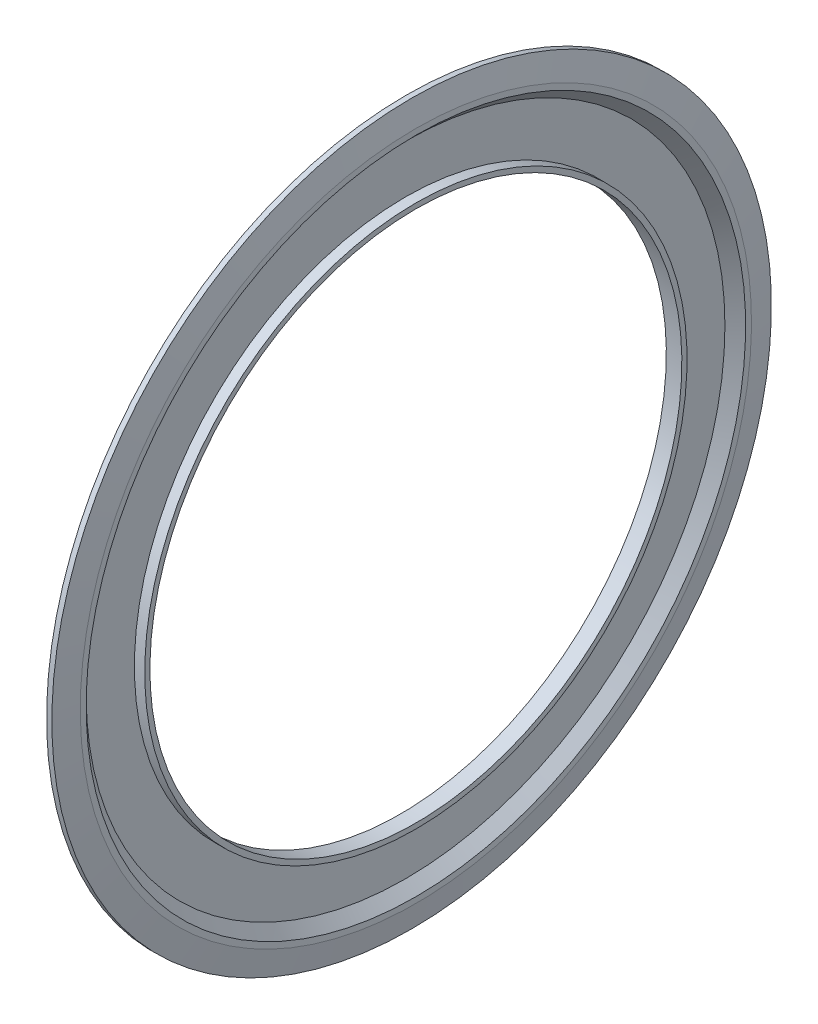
ISO-10303-21;
HEADER;
FILE_DESCRIPTION(('STEP AP214'),'2;1');
FILE_NAME('part.step','',(''),(''),'','','');
FILE_SCHEMA(('AUTOMOTIVE_DESIGN { 1 0 10303 214 1 1 1 1 }'));
ENDSEC;
DATA;
#1=APPLICATION_CONTEXT('core data for automotive mechanical design processes');
#2=APPLICATION_PROTOCOL_DEFINITION('international standard','automotive_design',2000,#1);
#3=PRODUCT_CONTEXT('',#1,'mechanical');
#4=PRODUCT('Part','Part','',(#3));
#5=PRODUCT_RELATED_PRODUCT_CATEGORY('part','',(#4));
#6=PRODUCT_DEFINITION_FORMATION('','',#4);
#7=PRODUCT_DEFINITION_CONTEXT('part definition',#1,'design');
#8=PRODUCT_DEFINITION('design','',#6,#7);
#9=PRODUCT_DEFINITION_SHAPE('','',#8);
#10=(LENGTH_UNIT() NAMED_UNIT(*) SI_UNIT(.MILLI.,.METRE.));
#11=(NAMED_UNIT(*) PLANE_ANGLE_UNIT() SI_UNIT($,.RADIAN.));
#12=(NAMED_UNIT(*) SI_UNIT($,.STERADIAN.) SOLID_ANGLE_UNIT());
#13=UNCERTAINTY_MEASURE_WITH_UNIT(LENGTH_MEASURE(1.E-05),#10,'distance_accuracy_value','');
#14=(GEOMETRIC_REPRESENTATION_CONTEXT(3) GLOBAL_UNCERTAINTY_ASSIGNED_CONTEXT((#13)) GLOBAL_UNIT_ASSIGNED_CONTEXT((#10,
#11,#12)) REPRESENTATION_CONTEXT('',''));
#15=CARTESIAN_POINT('',(0.,0.,0.));
#16=DIRECTION('',(0.,0.,1.));
#17=DIRECTION('',(1.,0.,0.));
#18=AXIS2_PLACEMENT_3D('',#15,#16,#17);
#19=CARTESIAN_POINT('',(1.32622244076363,21.783,0.));
#20=DIRECTION('',(1.,0.,0.));
#21=DIRECTION('',(0.,-1.,0.));
#22=AXIS2_PLACEMENT_3D('',#19,#20,#21);
#23=PLANE('',#22);
#24=CARTESIAN_POINT('',(1.32622244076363,0.,0.));
#25=DIRECTION('',(-1.,0.,0.));
#26=DIRECTION('',(0.,1.,0.));
#27=AXIS2_PLACEMENT_3D('',#24,#25,#26);
#28=CIRCLE('',#27,21.591);
#29=CARTESIAN_POINT('',(1.32622244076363,21.591,0.));
#30=VERTEX_POINT('',#29);
#31=EDGE_CURVE('E11',#30,#30,#28,.T.);
#32=ORIENTED_EDGE('',*,*,#31,.T.);
#33=EDGE_LOOP('',(#32));
#34=FACE_BOUND('',#33,.T.);
#35=CARTESIAN_POINT('',(1.32622244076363,0.,0.));
#36=DIRECTION('',(-1.,0.,0.));
#37=DIRECTION('',(0.,1.,0.));
#38=AXIS2_PLACEMENT_3D('',#35,#36,#37);
#39=CIRCLE('',#38,21.975);
#40=CARTESIAN_POINT('',(1.32622244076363,21.975,0.));
#41=VERTEX_POINT('',#40);
#42=EDGE_CURVE('E77',#41,#41,#39,.T.);
#43=ORIENTED_EDGE('',*,*,#42,.F.);
#44=EDGE_LOOP('',(#43));
#45=FACE_BOUND('',#44,.T.);
#46=ADVANCED_FACE('F16',(#34,#45),#23,.T.);
#47=CARTESIAN_POINT('',(0.987222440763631,0.,0.));
#48=DIRECTION('',(1.,0.,0.));
#49=DIRECTION('',(0.,1.,0.));
#50=AXIS2_PLACEMENT_3D('',#47,#48,#49);
#51=CONICAL_SURFACE('',#50,21.252,0.785398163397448);
#52=CARTESIAN_POINT('',(0.648222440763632,0.,0.));
#53=DIRECTION('',(-1.,0.,0.));
#54=DIRECTION('',(0.,1.,0.));
#55=AXIS2_PLACEMENT_3D('',#52,#53,#54);
#56=CIRCLE('',#55,20.913);
#57=CARTESIAN_POINT('',(0.648222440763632,20.913,0.));
#58=VERTEX_POINT('',#57);
#59=EDGE_CURVE('E26',#58,#58,#56,.T.);
#60=ORIENTED_EDGE('',*,*,#59,.T.);
#61=EDGE_LOOP('',(#60));
#62=FACE_BOUND('',#61,.T.);
#63=ORIENTED_EDGE('',*,*,#31,.F.);
#64=EDGE_LOOP('',(#63));
#65=FACE_BOUND('',#64,.T.);
#66=ADVANCED_FACE('F109',(#62,#65),#51,.F.);
#67=CARTESIAN_POINT('',(0.648222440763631,19.3335,0.));
#68=DIRECTION('',(1.,0.,0.));
#69=DIRECTION('',(0.,-1.,0.));
#70=AXIS2_PLACEMENT_3D('',#67,#68,#69);
#71=PLANE('',#70);
#72=CARTESIAN_POINT('',(0.648222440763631,0.,0.));
#73=DIRECTION('',(-1.,0.,0.));
#74=DIRECTION('',(0.,1.,0.));
#75=AXIS2_PLACEMENT_3D('',#72,#73,#74);
#76=CIRCLE('',#75,17.754);
#77=CARTESIAN_POINT('',(0.648222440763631,17.754,0.));
#78=VERTEX_POINT('',#77);
#79=EDGE_CURVE('E85',#78,#78,#76,.T.);
#80=ORIENTED_EDGE('',*,*,#79,.T.);
#81=EDGE_LOOP('',(#80));
#82=FACE_BOUND('',#81,.T.);
#83=ORIENTED_EDGE('',*,*,#59,.F.);
#84=EDGE_LOOP('',(#83));
#85=FACE_BOUND('',#84,.T.);
#86=ADVANCED_FACE('F18',(#82,#85),#71,.T.);
#87=CARTESIAN_POINT('',(0.987222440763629,0.,0.));
#88=DIRECTION('',(1.,0.,0.));
#89=DIRECTION('',(0.,1.,0.));
#90=AXIS2_PLACEMENT_3D('',#87,#88,#89);
#91=CYLINDRICAL_SURFACE('',#90,17.754);
#92=CARTESIAN_POINT('',(1.32622244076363,0.,0.));
#93=DIRECTION('',(-1.,0.,0.));
#94=DIRECTION('',(0.,1.,0.));
#95=AXIS2_PLACEMENT_3D('',#92,#93,#94);
#96=CIRCLE('',#95,17.754);
#97=CARTESIAN_POINT('',(1.32622244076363,17.754,0.));
#98=VERTEX_POINT('',#97);
#99=EDGE_CURVE('E83',#98,#98,#96,.T.);
#100=ORIENTED_EDGE('',*,*,#99,.T.);
#101=EDGE_LOOP('',(#100));
#102=FACE_BOUND('',#101,.T.);
#103=ORIENTED_EDGE('',*,*,#79,.F.);
#104=EDGE_LOOP('',(#103));
#105=FACE_BOUND('',#104,.T.);
#106=ADVANCED_FACE('F137',(#102,#105),#91,.T.);
#107=CARTESIAN_POINT('',(1.32622244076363,17.5845,0.));
#108=DIRECTION('',(1.,0.,0.));
#109=DIRECTION('',(0.,-1.,0.));
#110=AXIS2_PLACEMENT_3D('',#107,#108,#109);
#111=PLANE('',#110);
#112=CARTESIAN_POINT('',(1.32622244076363,0.,0.));
#113=DIRECTION('',(-1.,0.,0.));
#114=DIRECTION('',(0.,1.,0.));
#115=AXIS2_PLACEMENT_3D('',#112,#113,#114);
#116=CIRCLE('',#115,17.415);
#117=CARTESIAN_POINT('',(1.32622244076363,17.415,0.));
#118=VERTEX_POINT('',#117);
#119=EDGE_CURVE('E57',#118,#118,#116,.T.);
#120=ORIENTED_EDGE('',*,*,#119,.T.);
#121=EDGE_LOOP('',(#120));
#122=FACE_BOUND('',#121,.T.);
#123=ORIENTED_EDGE('',*,*,#99,.F.);
#124=EDGE_LOOP('',(#123));
#125=FACE_BOUND('',#124,.T.);
#126=ADVANCED_FACE('F121',(#122,#125),#111,.T.);
#127=CARTESIAN_POINT('',(0.81772244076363,0.,0.));
#128=DIRECTION('',(1.,0.,0.));
#129=DIRECTION('',(0.,1.,0.));
#130=AXIS2_PLACEMENT_3D('',#127,#128,#129);
#131=CYLINDRICAL_SURFACE('',#130,17.415);
#132=CARTESIAN_POINT('',(0.30922244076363,0.,0.));
#133=DIRECTION('',(-1.,0.,0.));
#134=DIRECTION('',(0.,1.,0.));
#135=AXIS2_PLACEMENT_3D('',#132,#133,#134);
#136=CIRCLE('',#135,17.415);
#137=CARTESIAN_POINT('',(0.30922244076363,17.415,0.));
#138=VERTEX_POINT('',#137);
#139=EDGE_CURVE('E53',#138,#138,#136,.T.);
#140=ORIENTED_EDGE('',*,*,#139,.T.);
#141=EDGE_LOOP('',(#140));
#142=FACE_BOUND('',#141,.T.);
#143=ORIENTED_EDGE('',*,*,#119,.F.);
#144=EDGE_LOOP('',(#143));
#145=FACE_BOUND('',#144,.T.);
#146=ADVANCED_FACE('F117',(#142,#145),#131,.F.);
#147=CARTESIAN_POINT('',(0.30922244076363,19.2342091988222,0.));
#148=DIRECTION('',(-1.,0.,0.));
#149=DIRECTION('',(0.,1.,0.));
#150=AXIS2_PLACEMENT_3D('',#147,#148,#149);
#151=PLANE('',#150);
#152=CARTESIAN_POINT('',(0.309222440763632,0.,0.));
#153=DIRECTION('',(-1.,0.,0.));
#154=DIRECTION('',(0.,1.,0.));
#155=AXIS2_PLACEMENT_3D('',#152,#153,#154);
#156=CIRCLE('',#155,21.0534183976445);
#157=CARTESIAN_POINT('',(0.309222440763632,21.0534183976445,0.));
#158=VERTEX_POINT('',#157);
#159=EDGE_CURVE('E76',#158,#158,#156,.T.);
#160=ORIENTED_EDGE('',*,*,#159,.T.);
#161=EDGE_LOOP('',(#160));
#162=FACE_BOUND('',#161,.T.);
#163=ORIENTED_EDGE('',*,*,#139,.F.);
#164=EDGE_LOOP('',(#163));
#165=FACE_BOUND('',#164,.T.);
#166=ADVANCED_FACE('F120',(#162,#165),#151,.T.);
#167=CARTESIAN_POINT('',(0.648222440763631,0.,0.));
#168=DIRECTION('',(1.,0.,0.));
#169=DIRECTION('',(0.,1.,0.));
#170=AXIS2_PLACEMENT_3D('',#167,#168,#169);
#171=CONICAL_SURFACE('',#170,21.3924183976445,0.785398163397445);
#172=CARTESIAN_POINT('',(0.987222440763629,0.,0.));
#173=DIRECTION('',(-1.,0.,0.));
#174=DIRECTION('',(0.,1.,0.));
#175=AXIS2_PLACEMENT_3D('',#172,#173,#174);
#176=CIRCLE('',#175,21.7314183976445);
#177=CARTESIAN_POINT('',(0.987222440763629,21.7314183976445,0.));
#178=VERTEX_POINT('',#177);
#179=EDGE_CURVE('E20',#178,#178,#176,.T.);
#180=ORIENTED_EDGE('',*,*,#179,.T.);
#181=EDGE_LOOP('',(#180));
#182=FACE_BOUND('',#181,.T.);
#183=ORIENTED_EDGE('',*,*,#159,.F.);
#184=EDGE_LOOP('',(#183));
#185=FACE_BOUND('',#184,.T.);
#186=ADVANCED_FACE('F122',(#182,#185),#171,.T.);
#187=CARTESIAN_POINT('',(0.987222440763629,21.8383798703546,0.));
#188=DIRECTION('',(-1.,0.,0.));
#189=DIRECTION('',(0.,1.,0.));
#190=AXIS2_PLACEMENT_3D('',#187,#188,#189);
#191=PLANE('',#190);
#192=CARTESIAN_POINT('',(0.987222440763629,0.,0.));
#193=DIRECTION('',(-1.,0.,0.));
#194=DIRECTION('',(0.,1.,0.));
#195=AXIS2_PLACEMENT_3D('',#192,#193,#194);
#196=CIRCLE('',#195,21.9453413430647);
#197=CARTESIAN_POINT('',(0.987222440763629,21.9453413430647,0.));
#198=VERTEX_POINT('',#197);
#199=EDGE_CURVE('E70',#198,#198,#196,.T.);
#200=ORIENTED_EDGE('',*,*,#199,.T.);
#201=EDGE_LOOP('',(#200));
#202=FACE_BOUND('',#201,.T.);
#203=ORIENTED_EDGE('',*,*,#179,.F.);
#204=EDGE_LOOP('',(#203));
#205=FACE_BOUND('',#204,.T.);
#206=ADVANCED_FACE('F71',(#202,#205),#191,.T.);
#207=CARTESIAN_POINT('',(0.845132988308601,0.,0.));
#208=DIRECTION('',(-1.,0.,0.));
#209=DIRECTION('',(0.,1.,0.));
#210=AXIS2_PLACEMENT_3D('',#207,#208,#209);
#211=CONICAL_SURFACE('',#210,22.7511706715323,1.39626340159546);
#212=CARTESIAN_POINT('',(0.703043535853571,0.,0.));
#213=DIRECTION('',(-1.,0.,0.));
#214=DIRECTION('',(0.,1.,0.));
#215=AXIS2_PLACEMENT_3D('',#212,#213,#214);
#216=CIRCLE('',#215,23.557);
#217=CARTESIAN_POINT('',(0.703043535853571,23.557,0.));
#218=VERTEX_POINT('',#217);
#219=EDGE_CURVE('E74',#218,#218,#216,.T.);
#220=ORIENTED_EDGE('',*,*,#219,.T.);
#221=EDGE_LOOP('',(#220));
#222=FACE_BOUND('',#221,.T.);
#223=ORIENTED_EDGE('',*,*,#199,.F.);
#224=EDGE_LOOP('',(#223));
#225=FACE_BOUND('',#224,.T.);
#226=ADVANCED_FACE('F104',(#222,#225),#211,.F.);
#227=CARTESIAN_POINT('',(0.875158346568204,0.,0.));
#228=DIRECTION('',(1.,0.,0.));
#229=DIRECTION('',(0.,1.,0.));
#230=AXIS2_PLACEMENT_3D('',#227,#228,#229);
#231=CYLINDRICAL_SURFACE('',#230,23.557);
#232=CARTESIAN_POINT('',(1.04727315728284,0.,0.));
#233=DIRECTION('',(-1.,0.,0.));
#234=DIRECTION('',(0.,1.,0.));
#235=AXIS2_PLACEMENT_3D('',#232,#233,#234);
#236=CIRCLE('',#235,23.557);
#237=CARTESIAN_POINT('',(1.04727315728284,23.557,0.));
#238=VERTEX_POINT('',#237);
#239=EDGE_CURVE('E89',#238,#238,#236,.T.);
#240=ORIENTED_EDGE('',*,*,#239,.T.);
#241=EDGE_LOOP('',(#240));
#242=FACE_BOUND('',#241,.T.);
#243=ORIENTED_EDGE('',*,*,#219,.F.);
#244=EDGE_LOOP('',(#243));
#245=FACE_BOUND('',#244,.T.);
#246=ADVANCED_FACE('F94',(#242,#245),#231,.T.);
#247=CARTESIAN_POINT('',(1.18674779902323,0.,0.));
#248=DIRECTION('',(-1.,0.,0.));
#249=DIRECTION('',(0.,1.,0.));
#250=AXIS2_PLACEMENT_3D('',#247,#248,#249);
#251=CONICAL_SURFACE('',#250,22.766,1.39626340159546);
#252=ORIENTED_EDGE('',*,*,#42,.T.);
#253=EDGE_LOOP('',(#252));
#254=FACE_BOUND('',#253,.T.);
#255=ORIENTED_EDGE('',*,*,#239,.F.);
#256=EDGE_LOOP('',(#255));
#257=FACE_BOUND('',#256,.T.);
#258=ADVANCED_FACE('F97',(#254,#257),#251,.T.);
#259=CLOSED_SHELL('',(#46,#66,#86,#106,#126,#146,#166,#186,#206,#226,#246,#258));
#260=MANIFOLD_SOLID_BREP('B1',#259);
#261=ADVANCED_BREP_SHAPE_REPRESENTATION('',(#18,#260),#14);
#262=SHAPE_DEFINITION_REPRESENTATION(#9,#261);
ENDSEC;
END-ISO-10303-21;
